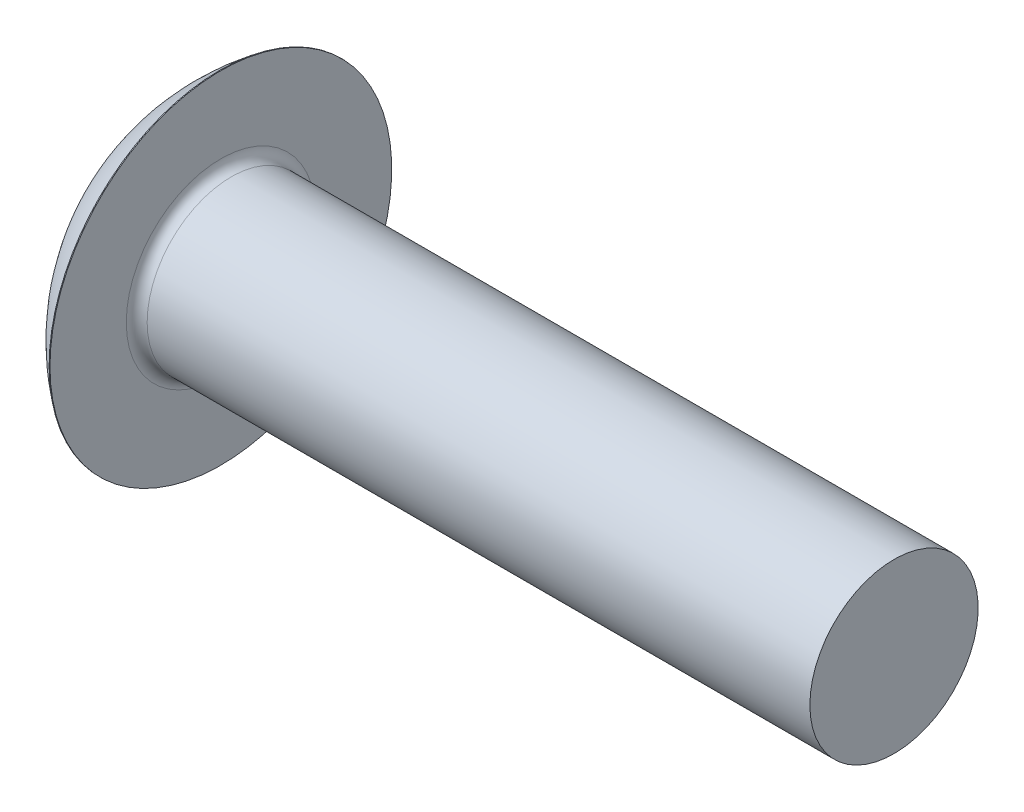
from build123d import *


with BuildPart() as part:
    # BodySke → Base-Revolve (revolve)
    with BuildSketch(Plane.XY, mode=Mode.PRIVATE) as base_revolve_sk:
        with BuildLine():
            Line((0, 0), (114.7064, 0))
            Line((114.7064, 0), (114.7064, 12.7))
            Line((114.7064, 12.7), (14.6812, 12.7))
            ThreePointArc((14.6812, 12.7), (13.567648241, 13.161248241), (13.1064, 14.2748))
            Line((13.1064, 14.2748), (13.1064, 25.7937))
            Line((13.1064, 25.7937), (12.9794, 25.7937))
            ThreePointArc((12.9794, 25.7937), (3.427753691, 14.437622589), (0, 0))
        make_face()
    revolve(base_revolve_sk.sketch.rotate(Axis((0, 0, 0), (1, 0, 0)), 90), axis=Axis((0, 0, 0), (1, 0, 0)))


solid = part.part
